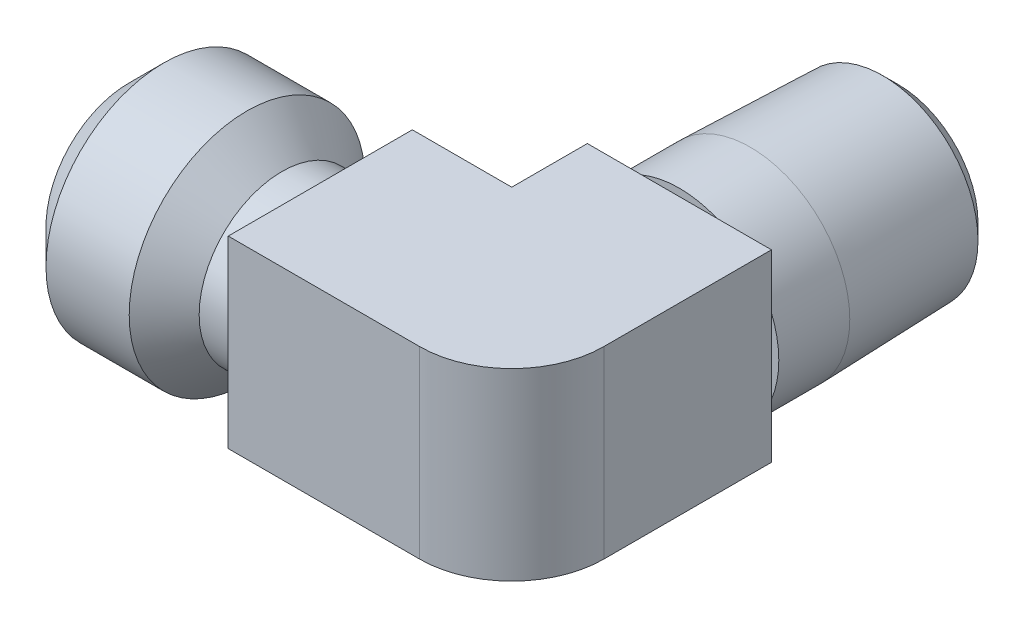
ISO-10303-21;
HEADER;
FILE_DESCRIPTION(('STEP AP214'),'2;1');
FILE_NAME('part.step','',(''),(''),'','','');
FILE_SCHEMA(('AUTOMOTIVE_DESIGN { 1 0 10303 214 1 1 1 1 }'));
ENDSEC;
DATA;
#1=APPLICATION_CONTEXT('core data for automotive mechanical design processes');
#2=APPLICATION_PROTOCOL_DEFINITION('international standard','automotive_design',2000,#1);
#3=PRODUCT_CONTEXT('',#1,'mechanical');
#4=PRODUCT('Part','Part','',(#3));
#5=PRODUCT_RELATED_PRODUCT_CATEGORY('part','',(#4));
#6=PRODUCT_DEFINITION_FORMATION('','',#4);
#7=PRODUCT_DEFINITION_CONTEXT('part definition',#1,'design');
#8=PRODUCT_DEFINITION('design','',#6,#7);
#9=PRODUCT_DEFINITION_SHAPE('','',#8);
#10=(LENGTH_UNIT() NAMED_UNIT(*) SI_UNIT(.MILLI.,.METRE.));
#11=(NAMED_UNIT(*) PLANE_ANGLE_UNIT() SI_UNIT($,.RADIAN.));
#12=(NAMED_UNIT(*) SI_UNIT($,.STERADIAN.) SOLID_ANGLE_UNIT());
#13=UNCERTAINTY_MEASURE_WITH_UNIT(LENGTH_MEASURE(1.E-05),#10,'distance_accuracy_value','');
#14=(GEOMETRIC_REPRESENTATION_CONTEXT(3) GLOBAL_UNCERTAINTY_ASSIGNED_CONTEXT((#13)) GLOBAL_UNIT_ASSIGNED_CONTEXT((#10,
#11,#12)) REPRESENTATION_CONTEXT('',''));
#15=CARTESIAN_POINT('',(0.,0.,0.));
#16=DIRECTION('',(0.,0.,1.));
#17=DIRECTION('',(1.,0.,0.));
#18=AXIS2_PLACEMENT_3D('',#15,#16,#17);
#19=CARTESIAN_POINT('',(7.874,0.,0.));
#20=DIRECTION('',(1.,0.,0.));
#21=DIRECTION('',(0.,1.,0.));
#22=AXIS2_PLACEMENT_3D('',#19,#20,#21);
#23=PLANE('',#22);
#24=CARTESIAN_POINT('',(7.874,0.,0.));
#25=DIRECTION('',(1.,0.,0.));
#26=DIRECTION('',(0.,0.,-1.));
#27=AXIS2_PLACEMENT_3D('',#24,#25,#26);
#28=CIRCLE('',#27,4.7625);
#29=CARTESIAN_POINT('',(7.874,0.,-4.7625));
#30=VERTEX_POINT('',#29);
#31=EDGE_CURVE('E19',#30,#30,#28,.F.);
#32=ORIENTED_EDGE('',*,*,#31,.T.);
#33=EDGE_LOOP('',(#32));
#34=FACE_BOUND('',#33,.T.);
#35=CARTESIAN_POINT('',(7.874,0.,0.));
#36=DIRECTION('',(1.,0.,0.));
#37=DIRECTION('',(0.,0.,-1.));
#38=AXIS2_PLACEMENT_3D('',#35,#36,#37);
#39=CIRCLE('',#38,3.556);
#40=CARTESIAN_POINT('',(7.874,0.,-3.556));
#41=VERTEX_POINT('',#40);
#42=EDGE_CURVE('E98',#41,#41,#39,.T.);
#43=ORIENTED_EDGE('',*,*,#42,.T.);
#44=EDGE_LOOP('',(#43));
#45=FACE_BOUND('',#44,.T.);
#46=ADVANCED_FACE('F16',(#34,#45),#23,.F.);
#47=CARTESIAN_POINT('',(3.937,0.,0.));
#48=DIRECTION('',(1.,0.,0.));
#49=DIRECTION('',(0.,0.,-1.));
#50=AXIS2_PLACEMENT_3D('',#47,#48,#49);
#51=CYLINDRICAL_SURFACE('',#50,4.7625);
#52=CARTESIAN_POINT('',(0.,0.,0.));
#53=DIRECTION('',(1.,0.,0.));
#54=DIRECTION('',(0.,0.,-1.));
#55=AXIS2_PLACEMENT_3D('',#52,#53,#54);
#56=CIRCLE('',#55,4.7625);
#57=CARTESIAN_POINT('',(0.,0.,-4.7625));
#58=VERTEX_POINT('',#57);
#59=EDGE_CURVE('E97',#58,#58,#56,.T.);
#60=ORIENTED_EDGE('',*,*,#59,.F.);
#61=EDGE_LOOP('',(#60));
#62=FACE_BOUND('',#61,.T.);
#63=ORIENTED_EDGE('',*,*,#31,.F.);
#64=EDGE_LOOP('',(#63));
#65=FACE_BOUND('',#64,.T.);
#66=ADVANCED_FACE('F122',(#62,#65),#51,.F.);
#67=CARTESIAN_POINT('',(13.208,0.,0.));
#68=DIRECTION('',(1.,0.,0.));
#69=DIRECTION('',(0.,0.,-1.));
#70=AXIS2_PLACEMENT_3D('',#67,#68,#69);
#71=CYLINDRICAL_SURFACE('',#70,3.556);
#72=CARTESIAN_POINT('',(26.416,0.,0.));
#73=DIRECTION('',(1.,0.,0.));
#74=DIRECTION('',(0.,0.,-1.));
#75=AXIS2_PLACEMENT_3D('',#72,#73,#74);
#76=CIRCLE('',#75,3.556);
#77=CARTESIAN_POINT('',(26.416,3.556,0.));
#78=VERTEX_POINT('',#77);
#79=CARTESIAN_POINT('',(26.416,-3.556,0.));
#80=VERTEX_POINT('',#79);
#81=EDGE_CURVE('E85',#78,#80,#76,.T.);
#82=ORIENTED_EDGE('',*,*,#81,.T.);
#83=CARTESIAN_POINT('',(26.416,0.,0.));
#84=DIRECTION('',(0.707106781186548,0.,-0.707106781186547));
#85=DIRECTION('',(0.707106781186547,0.,0.707106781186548));
#86=AXIS2_PLACEMENT_3D('',#83,#84,#85);
#87=ELLIPSE('',#86,5.02894342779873,3.556);
#88=EDGE_CURVE('E83',#80,#78,#87,.T.);
#89=ORIENTED_EDGE('',*,*,#88,.T.);
#90=EDGE_LOOP('',(#82,#89));
#91=FACE_BOUND('',#90,.T.);
#92=ORIENTED_EDGE('',*,*,#42,.F.);
#93=EDGE_LOOP('',(#92));
#94=FACE_BOUND('',#93,.T.);
#95=ADVANCED_FACE('F92',(#91,#94),#71,.F.);
#96=CARTESIAN_POINT('',(26.416,0.,0.));
#97=DIRECTION('',(0.338730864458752,0.937142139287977,0.0838213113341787));
#98=DIRECTION('',(-0.938389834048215,0.330008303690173,0.10256236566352));
#99=AXIS2_PLACEMENT_3D('',#96,#97,#98);
#100=SPHERICAL_SURFACE('',#99,3.556);
#101=CARTESIAN_POINT('',(27.6205269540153,3.33247744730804,0.29806858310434));
#102=VERTEX_POINT('',#101);
#103=VERTEX_LOOP('',#102);
#104=FACE_BOUND('',#103,.T.);
#105=ORIENTED_EDGE('',*,*,#81,.F.);
#106=CARTESIAN_POINT('',(26.416,0.,0.));
#107=DIRECTION('',(0.,0.,-1.));
#108=DIRECTION('',(-1.,0.,0.));
#109=AXIS2_PLACEMENT_3D('',#106,#107,#108);
#110=CIRCLE('',#109,3.556);
#111=EDGE_CURVE('E96',#78,#80,#110,.T.);
#112=ORIENTED_EDGE('',*,*,#111,.T.);
#113=EDGE_LOOP('',(#105,#112));
#114=FACE_BOUND('',#113,.T.);
#115=ADVANCED_FACE('F88',(#104,#114),#100,.F.);
#116=CARTESIAN_POINT('',(0.,0.,-4.064));
#117=DIRECTION('',(-1.,0.,0.));
#118=DIRECTION('',(0.,0.,1.));
#119=AXIS2_PLACEMENT_3D('',#116,#117,#118);
#120=PLANE('',#119);
#121=ORIENTED_EDGE('',*,*,#59,.T.);
#122=EDGE_LOOP('',(#121));
#123=FACE_BOUND('',#122,.T.);
#124=CARTESIAN_POINT('',(5.6844286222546E-11,0.,0.));
#125=DIRECTION('',(1.,0.,0.));
#126=DIRECTION('',(0.,0.,-1.));
#127=AXIS2_PLACEMENT_3D('',#124,#125,#126);
#128=CIRCLE('',#127,5.71500000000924);
#129=CARTESIAN_POINT('',(5.68453360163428E-11,0.,-5.71500000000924));
#130=VERTEX_POINT('',#129);
#131=EDGE_CURVE('E102',#130,#130,#128,.F.);
#132=ORIENTED_EDGE('',*,*,#131,.T.);
#133=EDGE_LOOP('',(#132));
#134=FACE_BOUND('',#133,.T.);
#135=ADVANCED_FACE('F91',(#123,#134),#120,.T.);
#136=CARTESIAN_POINT('',(26.416,0.,-19.11858));
#137=DIRECTION('',(0.,0.,-1.));
#138=DIRECTION('',(-1.,0.,0.));
#139=AXIS2_PLACEMENT_3D('',#136,#137,#138);
#140=CYLINDRICAL_SURFACE('',#139,3.556);
#141=CARTESIAN_POINT('',(26.416,0.,-26.67));
#142=DIRECTION('',(0.,0.,-1.));
#143=DIRECTION('',(-1.,0.,0.));
#144=AXIS2_PLACEMENT_3D('',#141,#142,#143);
#145=CIRCLE('',#144,3.556);
#146=CARTESIAN_POINT('',(22.86,0.,-26.67));
#147=VERTEX_POINT('',#146);
#148=EDGE_CURVE('E105',#147,#147,#145,.F.);
#149=ORIENTED_EDGE('',*,*,#148,.F.);
#150=EDGE_LOOP('',(#149));
#151=FACE_BOUND('',#150,.T.);
#152=ORIENTED_EDGE('',*,*,#88,.F.);
#153=ORIENTED_EDGE('',*,*,#111,.F.);
#154=EDGE_LOOP('',(#152,#153));
#155=FACE_BOUND('',#154,.T.);
#156=ADVANCED_FACE('F101',(#151,#155),#140,.F.);
#157=CARTESIAN_POINT('',(-5.68423690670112E-11,0.,0.));
#158=DIRECTION('',(1.,0.,0.));
#159=DIRECTION('',(0.,0.,-1.));
#160=AXIS2_PLACEMENT_3D('',#157,#158,#159);
#161=CONICAL_SURFACE('',#160,5.71499999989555,0.785398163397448);
#162=ORIENTED_EDGE('',*,*,#131,.F.);
#163=EDGE_LOOP('',(#162));
#164=FACE_BOUND('',#163,.T.);
#165=CARTESIAN_POINT('',(2.413,0.,0.));
#166=DIRECTION('',(-1.,0.,0.));
#167=DIRECTION('',(0.,0.,1.));
#168=AXIS2_PLACEMENT_3D('',#165,#166,#167);
#169=CIRCLE('',#168,8.128);
#170=CARTESIAN_POINT('',(2.413,0.,8.128));
#171=VERTEX_POINT('',#170);
#172=EDGE_CURVE('E239',#171,#171,#169,.F.);
#173=ORIENTED_EDGE('',*,*,#172,.F.);
#174=EDGE_LOOP('',(#173));
#175=FACE_BOUND('',#174,.T.);
#176=ADVANCED_FACE('F226',(#164,#175),#161,.T.);
#177=CARTESIAN_POINT('',(23.1458780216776,0.,-26.67));
#178=DIRECTION('',(0.,0.,-1.));
#179=DIRECTION('',(-1.,0.,0.));
#180=AXIS2_PLACEMENT_3D('',#177,#178,#179);
#181=PLANE('',#180);
#182=CARTESIAN_POINT('',(26.416,0.,-26.6700000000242));
#183=DIRECTION('',(0.,0.,1.));
#184=DIRECTION('',(1.,0.,0.));
#185=AXIS2_PLACEMENT_3D('',#182,#183,#184);
#186=CIRCLE('',#185,5.49782999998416);
#187=CARTESIAN_POINT('',(31.9138299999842,0.,-26.6700000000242));
#188=VERTEX_POINT('',#187);
#189=EDGE_CURVE('E281',#188,#188,#186,.F.);
#190=ORIENTED_EDGE('',*,*,#189,.T.);
#191=EDGE_LOOP('',(#190));
#192=FACE_BOUND('',#191,.T.);
#193=ORIENTED_EDGE('',*,*,#148,.T.);
#194=EDGE_LOOP('',(#193));
#195=FACE_BOUND('',#194,.T.);
#196=ADVANCED_FACE('F222',(#192,#195),#181,.T.);
#197=CARTESIAN_POINT('',(5.2832,0.,0.));
#198=DIRECTION('',(-1.,0.,0.));
#199=DIRECTION('',(0.,0.,1.));
#200=AXIS2_PLACEMENT_3D('',#197,#198,#199);
#201=CYLINDRICAL_SURFACE('',#200,8.128);
#202=CARTESIAN_POINT('',(8.15339999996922,0.,0.));
#203=DIRECTION('',(-1.,0.,0.));
#204=DIRECTION('',(0.,0.,-1.));
#205=AXIS2_PLACEMENT_3D('',#202,#203,#204);
#206=CIRCLE('',#205,8.12799999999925);
#207=CARTESIAN_POINT('',(8.15339999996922,0.,-8.12799999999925));
#208=VERTEX_POINT('',#207);
#209=EDGE_CURVE('E283',#208,#208,#206,.T.);
#210=ORIENTED_EDGE('',*,*,#209,.T.);
#211=EDGE_LOOP('',(#210));
#212=FACE_BOUND('',#211,.T.);
#213=ORIENTED_EDGE('',*,*,#172,.T.);
#214=EDGE_LOOP('',(#213));
#215=FACE_BOUND('',#214,.T.);
#216=ADVANCED_FACE('F218',(#212,#215),#201,.T.);
#217=CARTESIAN_POINT('',(26.416,0.,-26.6700000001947));
#218=DIRECTION('',(0.,0.,1.));
#219=DIRECTION('',(1.,0.,0.));
#220=AXIS2_PLACEMENT_3D('',#217,#218,#219);
#221=CONICAL_SURFACE('',#220,5.49782999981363,0.785398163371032);
#222=ORIENTED_EDGE('',*,*,#189,.F.);
#223=EDGE_LOOP('',(#222));
#224=FACE_BOUND('',#223,.T.);
#225=CARTESIAN_POINT('',(26.416,0.,-25.5940874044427));
#226=DIRECTION('',(0.,0.,1.));
#227=DIRECTION('',(-1.,0.,0.));
#228=AXIS2_PLACEMENT_3D('',#225,#226,#227);
#229=CIRCLE('',#228,6.57374259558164);
#230=CARTESIAN_POINT('',(19.8422574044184,0.,-25.5940874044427));
#231=VERTEX_POINT('',#230);
#232=EDGE_CURVE('E280',#231,#231,#229,.T.);
#233=ORIENTED_EDGE('',*,*,#232,.F.);
#234=EDGE_LOOP('',(#233));
#235=FACE_BOUND('',#234,.T.);
#236=ADVANCED_FACE('F214',(#224,#235),#221,.T.);
#237=CARTESIAN_POINT('',(10.5664000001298,0.,0.));
#238=DIRECTION('',(-1.,0.,0.));
#239=DIRECTION('',(0.,0.,1.));
#240=AXIS2_PLACEMENT_3D('',#237,#238,#239);
#241=CONICAL_SURFACE('',#240,5.71499999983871,0.785398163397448);
#242=CARTESIAN_POINT('',(10.5664,0.,0.));
#243=DIRECTION('',(-1.,0.,0.));
#244=DIRECTION('',(0.,0.,1.));
#245=AXIS2_PLACEMENT_3D('',#242,#243,#244);
#246=CIRCLE('',#245,5.715);
#247=CARTESIAN_POINT('',(10.5664,0.,5.715));
#248=VERTEX_POINT('',#247);
#249=EDGE_CURVE('E276',#248,#248,#246,.F.);
#250=ORIENTED_EDGE('',*,*,#249,.F.);
#251=EDGE_LOOP('',(#250));
#252=FACE_BOUND('',#251,.T.);
#253=ORIENTED_EDGE('',*,*,#209,.F.);
#254=EDGE_LOOP('',(#253));
#255=FACE_BOUND('',#254,.T.);
#256=ADVANCED_FACE('F210',(#252,#255),#241,.T.);
#257=CARTESIAN_POINT('',(26.416,0.,-16.4642800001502));
#258=DIRECTION('',(0.,0.,1.));
#259=DIRECTION('',(1.,0.,0.));
#260=AXIS2_PLACEMENT_3D('',#257,#258,#259);
#261=CONICAL_SURFACE('',#260,6.85799999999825,0.0311250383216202);
#262=ORIENTED_EDGE('',*,*,#232,.T.);
#263=EDGE_LOOP('',(#262));
#264=FACE_BOUND('',#263,.T.);
#265=CARTESIAN_POINT('',(26.416,0.,-16.46428));
#266=DIRECTION('',(0.,0.,1.));
#267=DIRECTION('',(1.,0.,0.));
#268=AXIS2_PLACEMENT_3D('',#265,#266,#267);
#269=CIRCLE('',#268,6.858);
#270=CARTESIAN_POINT('',(33.274,0.,-16.46428));
#271=VERTEX_POINT('',#270);
#272=EDGE_CURVE('E272',#271,#271,#269,.T.);
#273=ORIENTED_EDGE('',*,*,#272,.F.);
#274=EDGE_LOOP('',(#273));
#275=FACE_BOUND('',#274,.T.);
#276=ADVANCED_FACE('F206',(#264,#275),#261,.T.);
#277=CARTESIAN_POINT('',(22.987,0.,-11.56716));
#278=DIRECTION('',(0.,0.,1.));
#279=DIRECTION('',(0.,-1.,0.));
#280=AXIS2_PLACEMENT_3D('',#277,#278,#279);
#281=PLANE('',#280);
#282=DIRECTION('',(1.,0.,0.));
#283=VECTOR('',#282,1.);
#284=CARTESIAN_POINT('',(13.208,6.35,-11.56716));
#285=LINE('',#284,#283);
#286=CARTESIAN_POINT('',(29.0063019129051,6.35,-11.56716));
#287=VERTEX_POINT('',#286);
#288=CARTESIAN_POINT('',(23.8256980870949,6.35,-11.56716));
#289=VERTEX_POINT('',#288);
#290=EDGE_CURVE('E301',#287,#289,#285,.F.);
#291=ORIENTED_EDGE('',*,*,#290,.F.);
#292=CARTESIAN_POINT('',(26.416,0.,-11.56716));
#293=DIRECTION('',(0.,0.,1.));
#294=DIRECTION('',(1.,0.,0.));
#295=AXIS2_PLACEMENT_3D('',#292,#293,#294);
#296=CIRCLE('',#295,6.858);
#297=EDGE_CURVE('E277',#287,#289,#296,.T.);
#298=ORIENTED_EDGE('',*,*,#297,.T.);
#299=EDGE_LOOP('',(#291,#298));
#300=FACE_BOUND('',#299,.T.);
#301=ADVANCED_FACE('F202',(#300),#281,.T.);
#302=CARTESIAN_POINT('',(11.8872,0.,0.));
#303=DIRECTION('',(-1.,0.,0.));
#304=DIRECTION('',(0.,0.,1.));
#305=AXIS2_PLACEMENT_3D('',#302,#303,#304);
#306=CYLINDRICAL_SURFACE('',#305,5.715);
#307=CARTESIAN_POINT('',(13.208,0.,0.));
#308=DIRECTION('',(-1.,0.,0.));
#309=DIRECTION('',(0.,0.,1.));
#310=AXIS2_PLACEMENT_3D('',#307,#308,#309);
#311=CIRCLE('',#310,5.715);
#312=CARTESIAN_POINT('',(13.208,0.,5.715));
#313=VERTEX_POINT('',#312);
#314=EDGE_CURVE('E258',#313,#313,#311,.F.);
#315=ORIENTED_EDGE('',*,*,#314,.F.);
#316=EDGE_LOOP('',(#315));
#317=FACE_BOUND('',#316,.T.);
#318=ORIENTED_EDGE('',*,*,#249,.T.);
#319=EDGE_LOOP('',(#318));
#320=FACE_BOUND('',#319,.T.);
#321=ADVANCED_FACE('F198',(#317,#320),#306,.T.);
#322=CARTESIAN_POINT('',(29.591,0.,-11.56716));
#323=DIRECTION('',(0.,0.,-1.));
#324=DIRECTION('',(-1.,0.,0.));
#325=AXIS2_PLACEMENT_3D('',#322,#323,#324);
#326=PLANE('',#325);
#327=DIRECTION('',(0.,1.,0.));
#328=VECTOR('',#327,1.);
#329=CARTESIAN_POINT('',(20.066,6.35,-11.56716));
#330=LINE('',#329,#328);
#331=CARTESIAN_POINT('',(20.066,6.35,-11.56716));
#332=VERTEX_POINT('',#331);
#333=CARTESIAN_POINT('',(20.066,2.59030191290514,-11.56716));
#334=VERTEX_POINT('',#333);
#335=EDGE_CURVE('E326',#332,#334,#330,.F.);
#336=ORIENTED_EDGE('',*,*,#335,.F.);
#337=DIRECTION('',(1.,0.,0.));
#338=VECTOR('',#337,1.);
#339=CARTESIAN_POINT('',(13.208,6.35,-11.56716));
#340=LINE('',#339,#338);
#341=EDGE_CURVE('E304',#289,#332,#340,.F.);
#342=ORIENTED_EDGE('',*,*,#341,.F.);
#343=CARTESIAN_POINT('',(26.416,0.,-11.56716));
#344=DIRECTION('',(0.,0.,1.));
#345=DIRECTION('',(1.,0.,0.));
#346=AXIS2_PLACEMENT_3D('',#343,#344,#345);
#347=CIRCLE('',#346,6.858);
#348=EDGE_CURVE('E273',#289,#334,#347,.T.);
#349=ORIENTED_EDGE('',*,*,#348,.T.);
#350=EDGE_LOOP('',(#336,#342,#349));
#351=FACE_BOUND('',#350,.T.);
#352=ADVANCED_FACE('F194',(#351),#326,.T.);
#353=CARTESIAN_POINT('',(22.987,0.,-11.56716));
#354=DIRECTION('',(0.,0.,1.));
#355=DIRECTION('',(0.,-1.,0.));
#356=AXIS2_PLACEMENT_3D('',#353,#354,#355);
#357=PLANE('',#356);
#358=DIRECTION('',(0.,1.,0.));
#359=VECTOR('',#358,1.);
#360=CARTESIAN_POINT('',(20.066,6.35,-11.56716));
#361=LINE('',#360,#359);
#362=CARTESIAN_POINT('',(20.066,-2.59030191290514,-11.56716));
#363=VERTEX_POINT('',#362);
#364=EDGE_CURVE('E257',#334,#363,#361,.F.);
#365=ORIENTED_EDGE('',*,*,#364,.F.);
#366=CARTESIAN_POINT('',(26.416,0.,-11.56716));
#367=DIRECTION('',(0.,0.,1.));
#368=DIRECTION('',(1.,0.,0.));
#369=AXIS2_PLACEMENT_3D('',#366,#367,#368);
#370=CIRCLE('',#369,6.858);
#371=EDGE_CURVE('E270',#363,#334,#370,.F.);
#372=ORIENTED_EDGE('',*,*,#371,.F.);
#373=EDGE_LOOP('',(#365,#372));
#374=FACE_BOUND('',#373,.T.);
#375=ADVANCED_FACE('F190',(#374),#357,.T.);
#376=CARTESIAN_POINT('',(26.416,0.,-14.01572));
#377=DIRECTION('',(0.,0.,1.));
#378=DIRECTION('',(1.,0.,0.));
#379=AXIS2_PLACEMENT_3D('',#376,#377,#378);
#380=CYLINDRICAL_SURFACE('',#379,6.858);
#381=ORIENTED_EDGE('',*,*,#272,.T.);
#382=EDGE_LOOP('',(#381));
#383=FACE_BOUND('',#382,.T.);
#384=CARTESIAN_POINT('',(26.416,0.,-11.56716));
#385=DIRECTION('',(0.,0.,1.));
#386=DIRECTION('',(1.,0.,0.));
#387=AXIS2_PLACEMENT_3D('',#384,#385,#386);
#388=CIRCLE('',#387,6.858);
#389=CARTESIAN_POINT('',(23.8256980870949,-6.35,-11.56716));
#390=VERTEX_POINT('',#389);
#391=EDGE_CURVE('E254',#363,#390,#388,.T.);
#392=ORIENTED_EDGE('',*,*,#391,.F.);
#393=ORIENTED_EDGE('',*,*,#371,.T.);
#394=ORIENTED_EDGE('',*,*,#348,.F.);
#395=ORIENTED_EDGE('',*,*,#297,.F.);
#396=CARTESIAN_POINT('',(26.416,0.,-11.56716));
#397=DIRECTION('',(0.,0.,1.));
#398=DIRECTION('',(1.,0.,0.));
#399=AXIS2_PLACEMENT_3D('',#396,#397,#398);
#400=CIRCLE('',#399,6.858);
#401=CARTESIAN_POINT('',(32.766,2.59030191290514,-11.56716));
#402=VERTEX_POINT('',#401);
#403=EDGE_CURVE('E263',#402,#287,#400,.T.);
#404=ORIENTED_EDGE('',*,*,#403,.F.);
#405=CARTESIAN_POINT('',(26.416,0.,-11.56716));
#406=DIRECTION('',(0.,0.,1.));
#407=DIRECTION('',(1.,0.,0.));
#408=AXIS2_PLACEMENT_3D('',#405,#406,#407);
#409=CIRCLE('',#408,6.858);
#410=CARTESIAN_POINT('',(32.766,-2.59030191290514,-11.56716));
#411=VERTEX_POINT('',#410);
#412=EDGE_CURVE('E267',#411,#402,#409,.T.);
#413=ORIENTED_EDGE('',*,*,#412,.F.);
#414=CARTESIAN_POINT('',(26.416,0.,-11.56716));
#415=DIRECTION('',(0.,0.,1.));
#416=DIRECTION('',(1.,0.,0.));
#417=AXIS2_PLACEMENT_3D('',#414,#415,#416);
#418=CIRCLE('',#417,6.858);
#419=CARTESIAN_POINT('',(29.0063019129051,-6.35,-11.56716));
#420=VERTEX_POINT('',#419);
#421=EDGE_CURVE('E246',#420,#411,#418,.T.);
#422=ORIENTED_EDGE('',*,*,#421,.F.);
#423=CARTESIAN_POINT('',(26.416,0.,-11.56716));
#424=DIRECTION('',(0.,0.,1.));
#425=DIRECTION('',(1.,0.,0.));
#426=AXIS2_PLACEMENT_3D('',#423,#424,#425);
#427=CIRCLE('',#426,6.858);
#428=EDGE_CURVE('E250',#390,#420,#427,.T.);
#429=ORIENTED_EDGE('',*,*,#428,.F.);
#430=EDGE_LOOP('',(#392,#393,#394,#395,#404,#413,#422,#429));
#431=FACE_BOUND('',#430,.T.);
#432=ADVANCED_FACE('F186',(#383,#431),#380,.T.);
#433=CARTESIAN_POINT('',(22.987,0.,-11.56716));
#434=DIRECTION('',(0.,0.,1.));
#435=DIRECTION('',(0.,-1.,0.));
#436=AXIS2_PLACEMENT_3D('',#433,#434,#435);
#437=PLANE('',#436);
#438=DIRECTION('',(0.,1.,0.));
#439=VECTOR('',#438,1.);
#440=CARTESIAN_POINT('',(32.766,-6.35,-11.56716));
#441=LINE('',#440,#439);
#442=EDGE_CURVE('E333',#411,#402,#441,.T.);
#443=ORIENTED_EDGE('',*,*,#442,.F.);
#444=ORIENTED_EDGE('',*,*,#412,.T.);
#445=EDGE_LOOP('',(#443,#444));
#446=FACE_BOUND('',#445,.T.);
#447=ADVANCED_FACE('F182',(#446),#437,.T.);
#448=CARTESIAN_POINT('',(29.591,0.,-11.56716));
#449=DIRECTION('',(0.,0.,-1.));
#450=DIRECTION('',(-1.,0.,0.));
#451=AXIS2_PLACEMENT_3D('',#448,#449,#450);
#452=PLANE('',#451);
#453=DIRECTION('',(1.,0.,0.));
#454=VECTOR('',#453,1.);
#455=CARTESIAN_POINT('',(13.208,6.35,-11.56716));
#456=LINE('',#455,#454);
#457=CARTESIAN_POINT('',(32.766,6.35,-11.56716));
#458=VERTEX_POINT('',#457);
#459=EDGE_CURVE('E266',#458,#287,#456,.F.);
#460=ORIENTED_EDGE('',*,*,#459,.F.);
#461=DIRECTION('',(0.,1.,0.));
#462=VECTOR('',#461,1.);
#463=CARTESIAN_POINT('',(32.766,-6.35,-11.56716));
#464=LINE('',#463,#462);
#465=EDGE_CURVE('E336',#402,#458,#464,.T.);
#466=ORIENTED_EDGE('',*,*,#465,.F.);
#467=ORIENTED_EDGE('',*,*,#403,.T.);
#468=EDGE_LOOP('',(#460,#466,#467));
#469=FACE_BOUND('',#468,.T.);
#470=ADVANCED_FACE('F178',(#469),#452,.T.);
#471=CARTESIAN_POINT('',(13.208,6.35,6.35));
#472=DIRECTION('',(0.,1.,0.));
#473=DIRECTION('',(0.,0.,1.));
#474=AXIS2_PLACEMENT_3D('',#471,#472,#473);
#475=PLANE('',#474);
#476=DIRECTION('',(1.,0.,0.));
#477=VECTOR('',#476,1.);
#478=CARTESIAN_POINT('',(13.208,6.35,6.35));
#479=LINE('',#478,#477);
#480=CARTESIAN_POINT('',(26.416,6.35,6.35));
#481=VERTEX_POINT('',#480);
#482=CARTESIAN_POINT('',(13.208,6.35,6.35));
#483=VERTEX_POINT('',#482);
#484=EDGE_CURVE('E262',#481,#483,#479,.F.);
#485=ORIENTED_EDGE('',*,*,#484,.F.);
#486=CARTESIAN_POINT('',(26.416,6.35,0.));
#487=DIRECTION('',(0.,-1.,0.));
#488=DIRECTION('',(0.,0.,-1.));
#489=AXIS2_PLACEMENT_3D('',#486,#487,#488);
#490=CIRCLE('',#489,6.35);
#491=CARTESIAN_POINT('',(32.766,6.35,0.));
#492=VERTEX_POINT('',#491);
#493=EDGE_CURVE('E242',#492,#481,#490,.T.);
#494=ORIENTED_EDGE('',*,*,#493,.F.);
#495=DIRECTION('',(0.,0.,-1.));
#496=VECTOR('',#495,1.);
#497=CARTESIAN_POINT('',(32.766,6.35,0.));
#498=LINE('',#497,#496);
#499=EDGE_CURVE('E341',#458,#492,#498,.F.);
#500=ORIENTED_EDGE('',*,*,#499,.F.);
#501=ORIENTED_EDGE('',*,*,#459,.T.);
#502=ORIENTED_EDGE('',*,*,#290,.T.);
#503=ORIENTED_EDGE('',*,*,#341,.T.);
#504=DIRECTION('',(0.,0.,1.));
#505=VECTOR('',#504,1.);
#506=CARTESIAN_POINT('',(20.066,6.35,0.));
#507=LINE('',#506,#505);
#508=CARTESIAN_POINT('',(20.066,6.35,-6.35));
#509=VERTEX_POINT('',#508);
#510=EDGE_CURVE('E323',#509,#332,#507,.F.);
#511=ORIENTED_EDGE('',*,*,#510,.F.);
#512=DIRECTION('',(-1.,0.,0.));
#513=VECTOR('',#512,1.);
#514=CARTESIAN_POINT('',(13.208,6.35,-6.35));
#515=LINE('',#514,#513);
#516=CARTESIAN_POINT('',(13.208,6.35,-6.35));
#517=VERTEX_POINT('',#516);
#518=EDGE_CURVE('E313',#517,#509,#515,.F.);
#519=ORIENTED_EDGE('',*,*,#518,.F.);
#520=DIRECTION('',(0.,0.,1.));
#521=VECTOR('',#520,1.);
#522=CARTESIAN_POINT('',(13.208,6.35,-3.175));
#523=LINE('',#522,#521);
#524=EDGE_CURVE('E307',#483,#517,#523,.F.);
#525=ORIENTED_EDGE('',*,*,#524,.F.);
#526=EDGE_LOOP('',(#485,#494,#500,#501,#502,#503,#511,#519,#525));
#527=FACE_BOUND('',#526,.T.);
#528=ADVANCED_FACE('F174',(#527),#475,.T.);
#529=CARTESIAN_POINT('',(13.208,-6.35,6.35));
#530=DIRECTION('',(0.,0.,1.));
#531=DIRECTION('',(0.,-1.,0.));
#532=AXIS2_PLACEMENT_3D('',#529,#530,#531);
#533=PLANE('',#532);
#534=DIRECTION('',(0.,-1.,0.));
#535=VECTOR('',#534,1.);
#536=CARTESIAN_POINT('',(26.416,0.,6.35));
#537=LINE('',#536,#535);
#538=CARTESIAN_POINT('',(26.416,-6.35,6.35));
#539=VERTEX_POINT('',#538);
#540=EDGE_CURVE('E353',#481,#539,#537,.T.);
#541=ORIENTED_EDGE('',*,*,#540,.F.);
#542=ORIENTED_EDGE('',*,*,#484,.T.);
#543=DIRECTION('',(0.,1.,0.));
#544=VECTOR('',#543,1.);
#545=CARTESIAN_POINT('',(13.208,0.,6.35));
#546=LINE('',#545,#544);
#547=CARTESIAN_POINT('',(13.208,-6.35,6.35));
#548=VERTEX_POINT('',#547);
#549=EDGE_CURVE('E261',#548,#483,#546,.T.);
#550=ORIENTED_EDGE('',*,*,#549,.F.);
#551=DIRECTION('',(1.,0.,0.));
#552=VECTOR('',#551,1.);
#553=CARTESIAN_POINT('',(13.208,-6.35,6.35));
#554=LINE('',#553,#552);
#555=EDGE_CURVE('E245',#539,#548,#554,.F.);
#556=ORIENTED_EDGE('',*,*,#555,.F.);
#557=EDGE_LOOP('',(#541,#542,#550,#556));
#558=FACE_BOUND('',#557,.T.);
#559=ADVANCED_FACE('F170',(#558),#533,.T.);
#560=CARTESIAN_POINT('',(13.208,0.,-3.175));
#561=DIRECTION('',(-1.,0.,0.));
#562=DIRECTION('',(0.,0.,1.));
#563=AXIS2_PLACEMENT_3D('',#560,#561,#562);
#564=PLANE('',#563);
#565=ORIENTED_EDGE('',*,*,#524,.T.);
#566=DIRECTION('',(0.,1.,0.));
#567=VECTOR('',#566,1.);
#568=CARTESIAN_POINT('',(13.208,6.35,-6.35));
#569=LINE('',#568,#567);
#570=CARTESIAN_POINT('',(13.208,-6.35,-6.35));
#571=VERTEX_POINT('',#570);
#572=EDGE_CURVE('E310',#571,#517,#569,.T.);
#573=ORIENTED_EDGE('',*,*,#572,.F.);
#574=DIRECTION('',(0.,0.,1.));
#575=VECTOR('',#574,1.);
#576=CARTESIAN_POINT('',(13.208,-6.35,-6.35));
#577=LINE('',#576,#575);
#578=EDGE_CURVE('E360',#548,#571,#577,.F.);
#579=ORIENTED_EDGE('',*,*,#578,.F.);
#580=ORIENTED_EDGE('',*,*,#549,.T.);
#581=EDGE_LOOP('',(#565,#573,#579,#580));
#582=FACE_BOUND('',#581,.T.);
#583=ORIENTED_EDGE('',*,*,#314,.T.);
#584=EDGE_LOOP('',(#583));
#585=FACE_BOUND('',#584,.T.);
#586=ADVANCED_FACE('F166',(#582,#585),#564,.T.);
#587=CARTESIAN_POINT('',(13.208,6.35,-6.35));
#588=DIRECTION('',(0.,0.,-1.));
#589=DIRECTION('',(-1.,0.,0.));
#590=AXIS2_PLACEMENT_3D('',#587,#588,#589);
#591=PLANE('',#590);
#592=ORIENTED_EDGE('',*,*,#572,.T.);
#593=ORIENTED_EDGE('',*,*,#518,.T.);
#594=DIRECTION('',(0.,1.,0.));
#595=VECTOR('',#594,1.);
#596=CARTESIAN_POINT('',(20.066,6.35,-6.35));
#597=LINE('',#596,#595);
#598=CARTESIAN_POINT('',(20.066,-6.35,-6.35));
#599=VERTEX_POINT('',#598);
#600=EDGE_CURVE('E316',#599,#509,#597,.T.);
#601=ORIENTED_EDGE('',*,*,#600,.F.);
#602=DIRECTION('',(1.,0.,0.));
#603=VECTOR('',#602,1.);
#604=CARTESIAN_POINT('',(13.208,-6.35,-6.35));
#605=LINE('',#604,#603);
#606=EDGE_CURVE('E363',#571,#599,#605,.T.);
#607=ORIENTED_EDGE('',*,*,#606,.F.);
#608=EDGE_LOOP('',(#592,#593,#601,#607));
#609=FACE_BOUND('',#608,.T.);
#610=ADVANCED_FACE('F162',(#609),#591,.T.);
#611=CARTESIAN_POINT('',(20.066,6.35,0.));
#612=DIRECTION('',(-1.,0.,0.));
#613=DIRECTION('',(0.,0.,1.));
#614=AXIS2_PLACEMENT_3D('',#611,#612,#613);
#615=PLANE('',#614);
#616=DIRECTION('',(0.,1.,0.));
#617=VECTOR('',#616,1.);
#618=CARTESIAN_POINT('',(20.066,0.,-11.56716));
#619=LINE('',#618,#617);
#620=CARTESIAN_POINT('',(20.066,-6.35,-11.56716));
#621=VERTEX_POINT('',#620);
#622=EDGE_CURVE('E253',#621,#363,#619,.T.);
#623=ORIENTED_EDGE('',*,*,#622,.F.);
#624=DIRECTION('',(0.,0.,1.));
#625=VECTOR('',#624,1.);
#626=CARTESIAN_POINT('',(20.066,-6.35,-6.35));
#627=LINE('',#626,#625);
#628=EDGE_CURVE('E372',#599,#621,#627,.F.);
#629=ORIENTED_EDGE('',*,*,#628,.F.);
#630=ORIENTED_EDGE('',*,*,#600,.T.);
#631=ORIENTED_EDGE('',*,*,#510,.T.);
#632=ORIENTED_EDGE('',*,*,#335,.T.);
#633=ORIENTED_EDGE('',*,*,#364,.T.);
#634=EDGE_LOOP('',(#623,#629,#630,#631,#632,#633));
#635=FACE_BOUND('',#634,.T.);
#636=ADVANCED_FACE('F158',(#635),#615,.T.);
#637=CARTESIAN_POINT('',(29.591,0.,-11.56716));
#638=DIRECTION('',(0.,0.,-1.));
#639=DIRECTION('',(-1.,0.,0.));
#640=AXIS2_PLACEMENT_3D('',#637,#638,#639);
#641=PLANE('',#640);
#642=DIRECTION('',(1.,0.,0.));
#643=VECTOR('',#642,1.);
#644=CARTESIAN_POINT('',(13.208,-6.35,-11.56716));
#645=LINE('',#644,#643);
#646=EDGE_CURVE('E381',#621,#390,#645,.T.);
#647=ORIENTED_EDGE('',*,*,#646,.F.);
#648=ORIENTED_EDGE('',*,*,#622,.T.);
#649=ORIENTED_EDGE('',*,*,#391,.T.);
#650=EDGE_LOOP('',(#647,#648,#649));
#651=FACE_BOUND('',#650,.T.);
#652=ADVANCED_FACE('F154',(#651),#641,.T.);
#653=CARTESIAN_POINT('',(22.987,0.,-11.56716));
#654=DIRECTION('',(0.,0.,1.));
#655=DIRECTION('',(0.,-1.,0.));
#656=AXIS2_PLACEMENT_3D('',#653,#654,#655);
#657=PLANE('',#656);
#658=DIRECTION('',(1.,0.,0.));
#659=VECTOR('',#658,1.);
#660=CARTESIAN_POINT('',(13.208,-6.35,-11.56716));
#661=LINE('',#660,#659);
#662=EDGE_CURVE('E390',#390,#420,#661,.T.);
#663=ORIENTED_EDGE('',*,*,#662,.F.);
#664=ORIENTED_EDGE('',*,*,#428,.T.);
#665=EDGE_LOOP('',(#663,#664));
#666=FACE_BOUND('',#665,.T.);
#667=ADVANCED_FACE('F150',(#666),#657,.T.);
#668=CARTESIAN_POINT('',(29.591,0.,-11.56716));
#669=DIRECTION('',(0.,0.,-1.));
#670=DIRECTION('',(-1.,0.,0.));
#671=AXIS2_PLACEMENT_3D('',#668,#669,#670);
#672=PLANE('',#671);
#673=DIRECTION('',(0.,1.,0.));
#674=VECTOR('',#673,1.);
#675=CARTESIAN_POINT('',(32.766,-6.35,-11.56716));
#676=LINE('',#675,#674);
#677=CARTESIAN_POINT('',(32.766,-6.35,-11.56716));
#678=VERTEX_POINT('',#677);
#679=EDGE_CURVE('E249',#678,#411,#676,.T.);
#680=ORIENTED_EDGE('',*,*,#679,.F.);
#681=DIRECTION('',(1.,0.,0.));
#682=VECTOR('',#681,1.);
#683=CARTESIAN_POINT('',(13.208,-6.35,-11.56716));
#684=LINE('',#683,#682);
#685=EDGE_CURVE('E393',#420,#678,#684,.T.);
#686=ORIENTED_EDGE('',*,*,#685,.F.);
#687=ORIENTED_EDGE('',*,*,#421,.T.);
#688=EDGE_LOOP('',(#680,#686,#687));
#689=FACE_BOUND('',#688,.T.);
#690=ADVANCED_FACE('F147',(#689),#672,.T.);
#691=CARTESIAN_POINT('',(32.766,-6.35,0.));
#692=DIRECTION('',(1.,0.,0.));
#693=DIRECTION('',(0.,0.,-1.));
#694=AXIS2_PLACEMENT_3D('',#691,#692,#693);
#695=PLANE('',#694);
#696=DIRECTION('',(0.,-1.,0.));
#697=VECTOR('',#696,1.);
#698=CARTESIAN_POINT('',(32.766,0.,0.));
#699=LINE('',#698,#697);
#700=CARTESIAN_POINT('',(32.766,-6.35,0.));
#701=VERTEX_POINT('',#700);
#702=EDGE_CURVE('E34',#701,#492,#699,.F.);
#703=ORIENTED_EDGE('',*,*,#702,.F.);
#704=DIRECTION('',(0.,0.,1.));
#705=VECTOR('',#704,1.);
#706=CARTESIAN_POINT('',(32.766,-6.35,-6.35));
#707=LINE('',#706,#705);
#708=EDGE_CURVE('E25',#678,#701,#707,.T.);
#709=ORIENTED_EDGE('',*,*,#708,.F.);
#710=ORIENTED_EDGE('',*,*,#679,.T.);
#711=ORIENTED_EDGE('',*,*,#442,.T.);
#712=ORIENTED_EDGE('',*,*,#465,.T.);
#713=ORIENTED_EDGE('',*,*,#499,.T.);
#714=EDGE_LOOP('',(#703,#709,#710,#711,#712,#713));
#715=FACE_BOUND('',#714,.T.);
#716=ADVANCED_FACE('F140',(#715),#695,.T.);
#717=CARTESIAN_POINT('',(26.416,0.,0.));
#718=DIRECTION('',(0.,-1.,0.));
#719=DIRECTION('',(0.,0.,-1.));
#720=AXIS2_PLACEMENT_3D('',#717,#718,#719);
#721=CYLINDRICAL_SURFACE('',#720,6.35);
#722=ORIENTED_EDGE('',*,*,#702,.T.);
#723=ORIENTED_EDGE('',*,*,#493,.T.);
#724=ORIENTED_EDGE('',*,*,#540,.T.);
#725=CARTESIAN_POINT('',(26.416,-6.35,0.));
#726=DIRECTION('',(0.,-1.,0.));
#727=DIRECTION('',(0.,0.,-1.));
#728=AXIS2_PLACEMENT_3D('',#725,#726,#727);
#729=CIRCLE('',#728,6.35);
#730=EDGE_CURVE('E11',#701,#539,#729,.T.);
#731=ORIENTED_EDGE('',*,*,#730,.F.);
#732=EDGE_LOOP('',(#722,#723,#724,#731));
#733=FACE_BOUND('',#732,.T.);
#734=ADVANCED_FACE('F134',(#733),#721,.T.);
#735=CARTESIAN_POINT('',(13.208,-6.35,-6.35));
#736=DIRECTION('',(0.,-1.,0.));
#737=DIRECTION('',(1.,0.,0.));
#738=AXIS2_PLACEMENT_3D('',#735,#736,#737);
#739=PLANE('',#738);
#740=ORIENTED_EDGE('',*,*,#708,.T.);
#741=ORIENTED_EDGE('',*,*,#730,.T.);
#742=ORIENTED_EDGE('',*,*,#555,.T.);
#743=ORIENTED_EDGE('',*,*,#578,.T.);
#744=ORIENTED_EDGE('',*,*,#606,.T.);
#745=ORIENTED_EDGE('',*,*,#628,.T.);
#746=ORIENTED_EDGE('',*,*,#646,.T.);
#747=ORIENTED_EDGE('',*,*,#662,.T.);
#748=ORIENTED_EDGE('',*,*,#685,.T.);
#749=EDGE_LOOP('',(#740,#741,#742,#743,#744,#745,#746,#747,#748));
#750=FACE_BOUND('',#749,.T.);
#751=ADVANCED_FACE('F132',(#750),#739,.T.);
#752=CLOSED_SHELL('',(#46,#66,#95,#115,#135,#156,#176,#196,#216,#236,#256,#276,#301,#321,#352,
#375,#432,#447,#470,#528,#559,#586,#610,#636,#652,#667,#690,#716,#734,#751));
#753=MANIFOLD_SOLID_BREP('B1',#752);
#754=ADVANCED_BREP_SHAPE_REPRESENTATION('',(#18,#753),#14);
#755=SHAPE_DEFINITION_REPRESENTATION(#9,#754);
ENDSEC;
END-ISO-10303-21;
